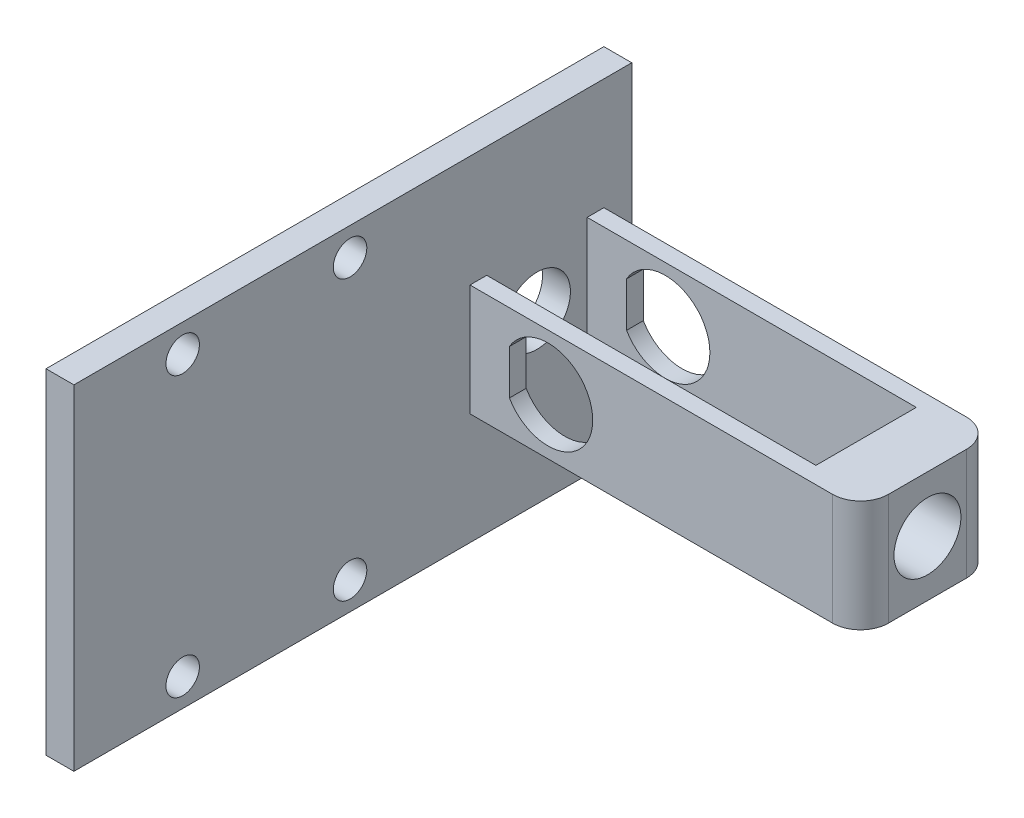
from build123d import *

# Parameters (mm, degrees)
SKETCH1_W               = 70
SKETCH1_H               = 20
BOSS_EXTRUDE1_DEPTH     = 24
SKETCH2_W               = 18
SKETCH2_H               = 20
CUT_EXTRUDE1_DEPTH      = 59
FILLET1_R               = 5
SKETCH3_W               = 100
SKETCH3_H               = 60
BOSS_EXTRUDE2_DEPTH     = 5
CUT_EXTRUDE2_DEPTH      = 119.410303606
CUT_EXTRUDE2_DEPTH_BACK = 119.410303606
SKETCH4_R               = 6
CUT_EXTRUDE3_DEPTH      = 87.838931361
F_6_0MM_DOWEL_HOLE1_D   = 6


with BuildPart() as part:
    # Sketch1 → Boss-Extrude1 (new body)
    with BuildSketch(Plane.XY):
        Rectangle(SKETCH1_W, SKETCH1_H)
    extrude(amount=BOSS_EXTRUDE1_DEPTH)

    # Sketch2 → Cut-Extrude1 (cut)
    with BuildSketch(Plane.ZY.offset(35)):
        with Locations((12, 0)):
            Rectangle(SKETCH2_W, SKETCH2_H)
    extrude(amount=-CUT_EXTRUDE1_DEPTH, mode=Mode.SUBTRACT)

    # Fillet1
    fillet1_edges = [part.edges().sort_by_distance(p)[0] for p in [
        (35, 0, 24),
        (35, 0, 0),
    ]]
    fillet(fillet1_edges, radius=FILLET1_R)

    # Sketch3 → Boss-Extrude2 (add)
    with BuildSketch(Plane.ZY.offset(35)):
        with Locations((45, 0)):
            Rectangle(SKETCH3_W, SKETCH3_H)
    extrude(amount=BOSS_EXTRUDE2_DEPTH)

    # Sketch4 → Cut-Extrude2 (cut, two sides: drawn at the far end of the back side and taken through both)
    with BuildSketch(Plane.ZY.offset(-24).offset(-CUT_EXTRUDE2_DEPTH_BACK)):
        with Locations((12, 0)):
            Circle(SKETCH4_R)
    extrude(amount=CUT_EXTRUDE2_DEPTH + CUT_EXTRUDE2_DEPTH_BACK, mode=Mode.SUBTRACT)

    # Sketch5 → Cut-Extrude3 (cut, through all)
    with BuildSketch(Plane.XY.offset(24)):
        with BuildLine():
            Line((-27.92820323, 4), (-27.92820323, -4))
            ThreePointArc((-27.92820323, -4), (-13, 0), (-27.92820323, 4))
        make_face()
    extrude(amount=-CUT_EXTRUDE3_DEPTH, mode=Mode.SUBTRACT)

    # 6.0mm Dowel Hole1 (through all)
    with Locations(Plane.ZY.offset(40)):
        with Locations((45.5, -25), (75.5, -25), (75.5, 25), (45.5, 25)):
            Hole(F_6_0MM_DOWEL_HOLE1_D / 2)


solid = part.part
